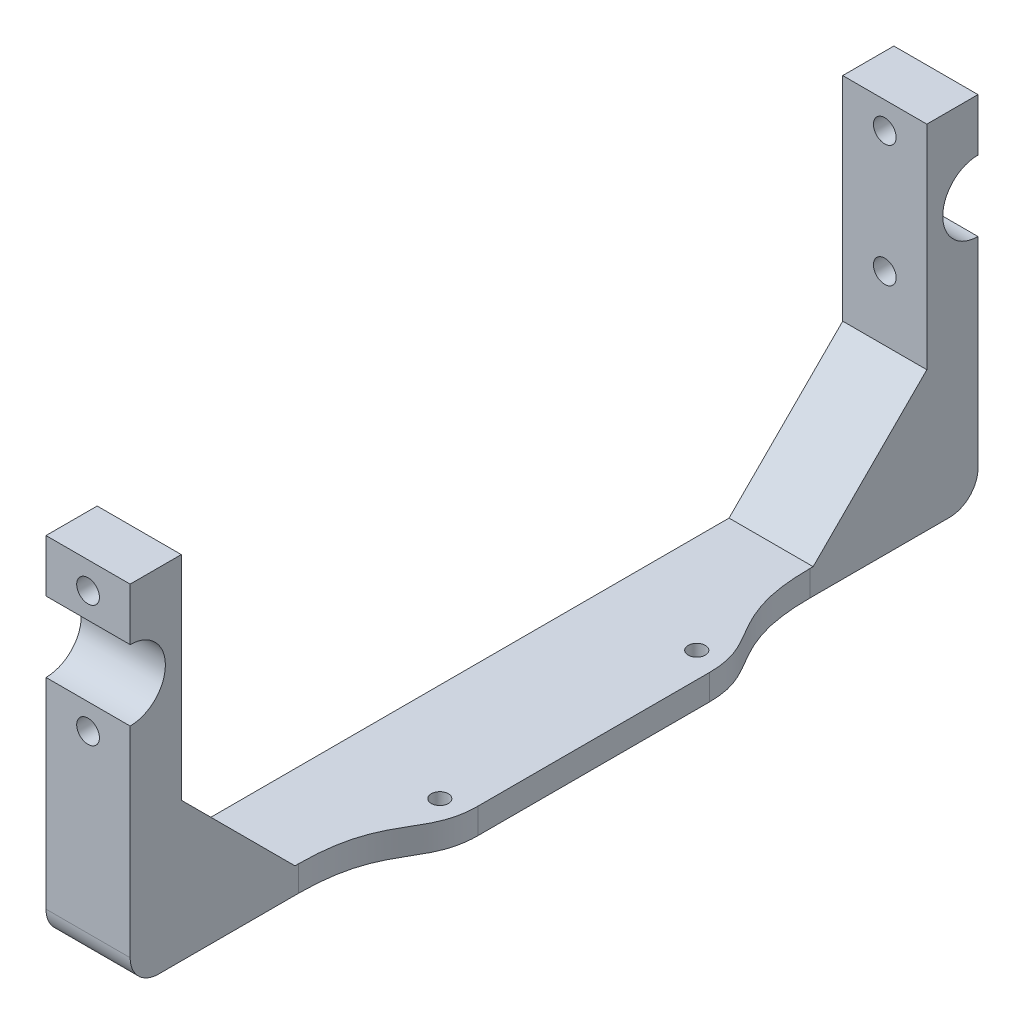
from build123d import *

# Parameters (mm, degrees)
SKETCH2_W               = 180
SKETCH2_H               = 9
BOSS_EXTRUDE1_DEPTH     = 14.8
SKETCH7_W               = 180
SKETCH7_H               = 4.5
CUT_EXTRUDE1_DEPTH      = 92.319713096
SKETCH8_W               = 90
SKETCH8_H               = 4.5
BOSS_EXTRUDE2_DEPTH     = 7
SKETCH10_R              = 1.5
CUT_EXTRUDE2_DEPTH      = 8
BOSS_EXTRUDE3_DEPTH     = 14.8
CUT_EXTRUDE3_DEPTH      = 178.187961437
CUT_EXTRUDE3_DEPTH_BACK = 178.187961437
SKETCH12_R              = 2
CUT_EXTRUDE4_DEPTH      = 112.397156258
CUT_EXTRUDE4_DEPTH_BACK = 112.397156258
SKETCH13_W              = 26.348017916
SKETCH13_H              = 14.929639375
FILLET2_R               = 5
CHAMFER1_SIZE           = 20


with BuildPart() as part:
    # Sketch2 → Boss-Extrude1 (new body)
    with BuildSketch(Plane(origin=(0, 0, 0), x_dir=(0, 0, -1), z_dir=(1, 0, 0))):
        Rectangle(SKETCH2_W, SKETCH2_H)
    extrude(amount=BOSS_EXTRUDE1_DEPTH)

    # Sketch7 → Cut-Extrude1 (cut, through all)
    with BuildSketch(Plane(origin=(14.8, 0, 0), x_dir=(0, 0, -1), z_dir=(1, 0, 0))):
        with Locations((0, -2.25)):
            Rectangle(SKETCH7_W, SKETCH7_H)
    extrude(amount=-CUT_EXTRUDE1_DEPTH, mode=Mode.SUBTRACT)

    # Sketch8 → Boss-Extrude2 (add)
    with BuildSketch(Plane(origin=(14.8, 0, 0), x_dir=(0, 0, -1), z_dir=(1, 0, 0))):
        with Locations((0, 2.25)):
            Rectangle(SKETCH8_W, SKETCH8_H)
    extrude(amount=BOSS_EXTRUDE2_DEPTH)

    # Sketch10 → Cut-Extrude2 (cut)
    with BuildSketch(Plane.XZ):
        with Locations(Location((17.299494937, -22.600505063, 0), (0, 0, 270))):
            Circle(SKETCH10_R)
        with Locations(Location((17.299494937, 22.600505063, 0), (0, 0, 270))):
            Circle(SKETCH10_R)
        with BuildLine():
            Line((21.8, -20.3664278), (30.172283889, -20.3664278))
            Line((30.172283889, -20.3664278), (30.172283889, -52.03884906))
            Line((30.172283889, -52.03884906), (14.8, -52.03884906))
            Line((14.8, -52.03884906), (14.8, -45))
            add(Edge.make_bspline(
                [(14.8, -45), (14.8, -29.785835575), (21.8, -29.785835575), (21.8, -20.3664278)],
                knots=[0, 0, 0, 0, 1, 1, 1, 1], degree=3))
        make_face()
        with BuildLine():
            Line((30.172283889, 52.03884906), (14.8, 52.03884906))
            Line((14.8, 52.03884906), (14.8, 45))
            add(Edge.make_bspline(
                [(14.8, 45), (14.8, 29.785835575), (21.8, 29.785835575), (21.8, 20.3664278)],
                knots=[0, 0, 0, 0, 1, 1, 1, 1], degree=3))
            Line((21.8, 20.3664278), (30.172283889, 20.3664278))
            Line((30.172283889, 20.3664278), (30.172283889, 52.03884906))
        make_face()
    extrude(amount=-CUT_EXTRUDE2_DEPTH, mode=Mode.SUBTRACT)

    # Sketch11 → Boss-Extrude3 (add)
    with BuildSketch(Plane(origin=(14.8, 0, 0), x_dir=(0, 0, -1), z_dir=(1, 0, 0))):
        with BuildLine():
            Line((74.579, 40.3), (74.579, 4.5))
            Line((74.579, 4.5), (65.579, 4.5))
            Line((65.579, 4.5), (65.579, 46.5))
            Line((65.579, 46.5), (65.579, 61.92))
            Line((65.579, 61.92), (74.579, 61.92))
            Line((74.579, 61.92), (74.579, 52.7))
            ThreePointArc((74.579, 52.7), (68.379, 46.5), (74.579, 40.3))
        make_face()
        with BuildLine():
            Line((-74.579, 52.7), (-74.579, 61.92))
            Line((-74.579, 61.92), (-65.579, 61.92))
            Line((-65.579, 61.92), (-65.579, 46.5))
            Line((-65.579, 46.5), (-65.579, 4.5))
            Line((-65.579, 4.5), (-74.579, 4.5))
            Line((-74.579, 4.5), (-74.579, 40.3))
            ThreePointArc((-74.579, 40.3), (-68.379, 46.5), (-74.579, 52.7))
        make_face()
    extrude(amount=-BOSS_EXTRUDE3_DEPTH)

    # Sketch12 → Cut-Extrude3 (cut, two sides: drawn at the far end of the back side and taken through both)
    with BuildSketch(Plane.XY.offset(74.579).offset(-CUT_EXTRUDE3_DEPTH_BACK)):
        with Locations((7.4, 57.2)):
            Circle(SKETCH12_R)
        with Locations((7.4, 35.8)):
            Circle(SKETCH12_R)
    extrude(amount=CUT_EXTRUDE3_DEPTH + CUT_EXTRUDE3_DEPTH_BACK, mode=Mode.SUBTRACT)

    # Sketch13 → Cut-Extrude4 (cut, two sides: drawn at the far end of the back side and taken through both)
    with BuildSketch(Plane.ZY.offset(-CUT_EXTRUDE4_DEPTH_BACK)):
        with Locations((87.753008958, -2.964819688)):
            Rectangle(SKETCH13_W, SKETCH13_H)
        with Locations((-87.753008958, -2.964819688)):
            Rectangle(SKETCH13_W, SKETCH13_H)
    extrude(amount=CUT_EXTRUDE4_DEPTH + CUT_EXTRUDE4_DEPTH_BACK, mode=Mode.SUBTRACT)

    # Fillet2
    fillet2_edges = [part.edges().sort_by_distance(p)[0] for p in [
        (7.4, 0, -74.579),
        (7.4, 0, 74.579),
    ]]
    fillet(fillet2_edges, radius=FILLET2_R)

    # Chamfer1
    chamfer1_edges = [part.edges().sort_by_distance(p)[0] for p in [
        (7.4, 4.5, 65.579),
        (7.4, 4.5, -65.579),
    ]]
    chamfer(chamfer1_edges, length=CHAMFER1_SIZE)


solid = part.part
